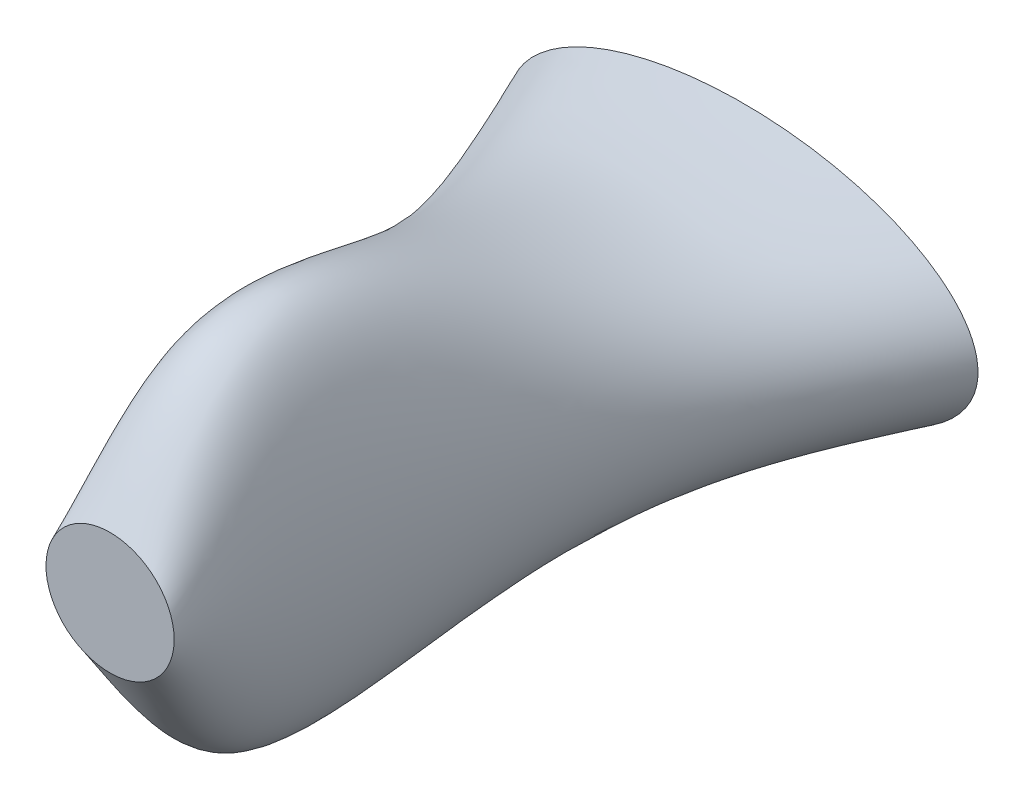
ISO-10303-21;
HEADER;
FILE_DESCRIPTION(('STEP AP214'),'2;1');
FILE_NAME('part.step','',(''),(''),'','','');
FILE_SCHEMA(('AUTOMOTIVE_DESIGN { 1 0 10303 214 1 1 1 1 }'));
ENDSEC;
DATA;
#1=APPLICATION_CONTEXT('core data for automotive mechanical design processes');
#2=APPLICATION_PROTOCOL_DEFINITION('international standard','automotive_design',2000,#1);
#3=PRODUCT_CONTEXT('',#1,'mechanical');
#4=PRODUCT('Part','Part','',(#3));
#5=PRODUCT_RELATED_PRODUCT_CATEGORY('part','',(#4));
#6=PRODUCT_DEFINITION_FORMATION('','',#4);
#7=PRODUCT_DEFINITION_CONTEXT('part definition',#1,'design');
#8=PRODUCT_DEFINITION('design','',#6,#7);
#9=PRODUCT_DEFINITION_SHAPE('','',#8);
#10=(LENGTH_UNIT() NAMED_UNIT(*) SI_UNIT(.MILLI.,.METRE.));
#11=(NAMED_UNIT(*) PLANE_ANGLE_UNIT() SI_UNIT($,.RADIAN.));
#12=(NAMED_UNIT(*) SI_UNIT($,.STERADIAN.) SOLID_ANGLE_UNIT());
#13=UNCERTAINTY_MEASURE_WITH_UNIT(LENGTH_MEASURE(1.E-05),#10,'distance_accuracy_value','');
#14=(GEOMETRIC_REPRESENTATION_CONTEXT(3) GLOBAL_UNCERTAINTY_ASSIGNED_CONTEXT((#13)) GLOBAL_UNIT_ASSIGNED_CONTEXT((#10,
#11,#12)) REPRESENTATION_CONTEXT('',''));
#15=CARTESIAN_POINT('',(0.,0.,0.));
#16=DIRECTION('',(0.,0.,1.));
#17=DIRECTION('',(1.,0.,0.));
#18=AXIS2_PLACEMENT_3D('',#15,#16,#17);
#19=CARTESIAN_POINT('',(0.,0.,-151.464362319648));
#20=DIRECTION('',(0.,0.,1.));
#21=DIRECTION('',(1.,0.,0.));
#22=AXIS2_PLACEMENT_3D('',#19,#20,#21);
#23=PLANE('',#22);
#24=CARTESIAN_POINT('',(0.,0.,-151.464362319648));
#25=DIRECTION('',(0.,0.,1.));
#26=DIRECTION('',(1.,0.,0.));
#27=AXIS2_PLACEMENT_3D('',#24,#25,#26);
#28=ELLIPSE('',#27,56.0560264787,27.662831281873);
#29=CARTESIAN_POINT('',(56.0560264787,0.,-151.464362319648));
#30=VERTEX_POINT('',#29);
#31=EDGE_CURVE('E102',#30,#30,#28,.T.);
#32=ORIENTED_EDGE('',*,*,#31,.F.);
#33=EDGE_LOOP('',(#32));
#34=FACE_BOUND('',#33,.T.);
#35=ADVANCED_FACE('F94',(#34),#23,.F.);
#36=CARTESIAN_POINT('',(0.,0.,0.));
#37=DIRECTION('',(0.,0.,1.));
#38=DIRECTION('',(1.,0.,0.));
#39=AXIS2_PLACEMENT_3D('',#36,#37,#38);
#40=PLANE('',#39);
#41=CARTESIAN_POINT('',(0.,0.,0.));
#42=DIRECTION('',(0.,0.,1.));
#43=DIRECTION('',(1.,0.,0.));
#44=AXIS2_PLACEMENT_3D('',#41,#42,#43);
#45=ELLIPSE('',#44,15.323084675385,14.5548406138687);
#46=CARTESIAN_POINT('',(15.323084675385,0.,0.));
#47=VERTEX_POINT('',#46);
#48=EDGE_CURVE('E12',#47,#47,#45,.T.);
#49=ORIENTED_EDGE('',*,*,#48,.T.);
#50=EDGE_LOOP('',(#49));
#51=FACE_BOUND('',#50,.T.);
#52=ADVANCED_FACE('F144',(#51),#40,.T.);
#53=CARTESIAN_POINT('',(15.323084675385,0.,0.));
#54=CARTESIAN_POINT('',(15.3993080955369,0.,-0.66532531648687));
#55=CARTESIAN_POINT('',(15.5517560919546,0.,-1.99598604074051));
#56=CARTESIAN_POINT('',(15.824305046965,0.,-4.37218259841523));
#57=CARTESIAN_POINT('',(16.1916155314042,0.,-7.56495651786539));
#58=CARTESIAN_POINT('',(16.619680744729,0.,-11.2566488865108));
#59=CARTESIAN_POINT('',(17.2613260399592,0.,-16.7174876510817));
#60=CARTESIAN_POINT('',(18.0074529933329,0.,-22.9079992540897));
#61=CARTESIAN_POINT('',(19.0113616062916,0.,-30.8443730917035));
#62=CARTESIAN_POINT('',(20.0065167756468,0.,-38.2537321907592));
#63=CARTESIAN_POINT('',(21.5855694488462,0.,-49.1798447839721));
#64=CARTESIAN_POINT('',(23.6306111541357,0.,-61.7064441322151));
#65=CARTESIAN_POINT('',(26.5409685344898,0.,-75.7873008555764));
#66=CARTESIAN_POINT('',(29.4590392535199,0.,-87.1882583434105));
#67=CARTESIAN_POINT('',(32.8723830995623,0.,-98.2047484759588));
#68=CARTESIAN_POINT('',(36.6541926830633,0.,-108.547991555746));
#69=CARTESIAN_POINT('',(40.617805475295,0.,-118.193903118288));
#70=CARTESIAN_POINT('',(43.8859964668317,0.,-125.640452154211));
#71=CARTESIAN_POINT('',(46.6965338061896,0.,-131.806796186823));
#72=CARTESIAN_POINT('',(49.172684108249,0.,-137.101183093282));
#73=CARTESIAN_POINT('',(51.6376850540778,0.,-142.286515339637));
#74=CARTESIAN_POINT('',(53.539104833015,0.,-146.244765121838));
#75=CARTESIAN_POINT('',(55.0545261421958,0.,-149.388658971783));
#76=CARTESIAN_POINT('',(55.7221727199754,0.,-150.772419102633));
#77=CARTESIAN_POINT('',(56.0560264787,0.,-151.464362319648));
#78=CARTESIAN_POINT('',(15.323084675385,-8.03303500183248,0.));
#79=CARTESIAN_POINT('',(15.3993080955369,-8.62540440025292,-0.66532531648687));
#80=CARTESIAN_POINT('',(15.5517560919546,-9.81015218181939,-1.99598604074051));
#81=CARTESIAN_POINT('',(15.824305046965,-11.8901105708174,-4.37218259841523));
#82=CARTESIAN_POINT('',(16.1916155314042,-14.5654500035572,-7.56495651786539));
#83=CARTESIAN_POINT('',(16.619680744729,-17.3215088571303,-11.2566488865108));
#84=CARTESIAN_POINT('',(17.2613260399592,-20.7094441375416,-16.7174876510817));
#85=CARTESIAN_POINT('',(18.0074529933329,-23.2738923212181,-22.9079992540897));
#86=CARTESIAN_POINT('',(19.0113616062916,-24.6886985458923,-30.8443730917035));
#87=CARTESIAN_POINT('',(20.0065167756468,-24.9453201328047,-38.2537321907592));
#88=CARTESIAN_POINT('',(21.5855694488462,-24.3547750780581,-49.1798447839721));
#89=CARTESIAN_POINT('',(23.6306111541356,-22.5209098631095,-61.7064441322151));
#90=CARTESIAN_POINT('',(26.5409685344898,-19.9379436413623,-75.7873008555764));
#91=CARTESIAN_POINT('',(29.4590392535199,-17.9657098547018,-87.1882583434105));
#92=CARTESIAN_POINT('',(32.8723830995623,-16.4025371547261,-98.2047484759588));
#93=CARTESIAN_POINT('',(36.6541926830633,-15.3149863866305,-108.547991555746));
#94=CARTESIAN_POINT('',(40.617805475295,-14.7413973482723,-118.193903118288));
#95=CARTESIAN_POINT('',(43.8859964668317,-14.5813491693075,-125.640452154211));
#96=CARTESIAN_POINT('',(46.6965338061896,-14.6107860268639,-131.806796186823));
#97=CARTESIAN_POINT('',(49.172684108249,-14.7255899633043,-137.101183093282));
#98=CARTESIAN_POINT('',(51.6376850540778,-14.8939135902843,-142.286515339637));
#99=CARTESIAN_POINT('',(53.539104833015,-15.0494373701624,-146.244765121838));
#100=CARTESIAN_POINT('',(55.0545261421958,-15.180010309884,-149.388658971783));
#101=CARTESIAN_POINT('',(55.7221727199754,-15.2383561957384,-150.772419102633));
#102=CARTESIAN_POINT('',(56.0560264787,-15.267531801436,-151.464362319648));
#103=CARTESIAN_POINT('',(8.45704043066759,-14.5548406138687,0.));
#104=CARTESIAN_POINT('',(8.4991092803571,-15.6281388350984,-0.66532531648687));
#105=CARTESIAN_POINT('',(8.58324761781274,-17.7747515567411,-1.99598604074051));
#106=CARTESIAN_POINT('',(8.73367147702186,-21.5433723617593,-4.37218259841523));
#107=CARTESIAN_POINT('',(8.93639564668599,-26.39074810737,-7.56495651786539));
#108=CARTESIAN_POINT('',(9.17265126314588,-31.3843772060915,-11.2566488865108));
#109=CARTESIAN_POINT('',(9.52678493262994,-37.5228862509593,-16.7174876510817));
#110=CARTESIAN_POINT('',(9.93858359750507,-42.1693411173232,-22.9079992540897));
#111=CARTESIAN_POINT('',(10.4926558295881,-44.7327905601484,-30.8443730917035));
#112=CARTESIAN_POINT('',(11.0418969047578,-45.1977563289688,-38.2537321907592));
#113=CARTESIAN_POINT('',(11.9133997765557,-44.1277635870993,-49.1798447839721));
#114=CARTESIAN_POINT('',(13.0420889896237,-40.8050324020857,-61.7064441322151));
#115=CARTESIAN_POINT('',(14.6483589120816,-36.1250251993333,-75.7873008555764));
#116=CARTESIAN_POINT('',(16.2588859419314,-32.5515877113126,-87.1882583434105));
#117=CARTESIAN_POINT('',(18.1427616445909,-29.719317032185,-98.2047484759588));
#118=CARTESIAN_POINT('',(20.2299991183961,-27.7488129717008,-108.547991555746));
#119=CARTESIAN_POINT('',(22.417576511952,-26.7095423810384,-118.193903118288));
#120=CARTESIAN_POINT('',(24.2213401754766,-26.4195553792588,-125.640452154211));
#121=CARTESIAN_POINT('',(25.7725179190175,-26.472891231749,-131.806796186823));
#122=CARTESIAN_POINT('',(27.1391424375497,-26.6809014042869,-137.101183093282));
#123=CARTESIAN_POINT('',(28.4996134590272,-26.9858824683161,-142.286515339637));
#124=CARTESIAN_POINT('',(29.5490355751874,-27.2676718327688,-146.244765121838));
#125=CARTESIAN_POINT('',(30.3854193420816,-27.5042534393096,-149.388658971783));
#126=CARTESIAN_POINT('',(30.7539035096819,-27.6099687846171,-150.772419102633));
#127=CARTESIAN_POINT('',(30.9381624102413,-27.662831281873,-151.464362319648));
#128=CARTESIAN_POINT('',(-8.4570404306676,-14.5548406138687,0.));
#129=CARTESIAN_POINT('',(-8.49910928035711,-15.6281388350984,-0.66532531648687));
#130=CARTESIAN_POINT('',(-8.58324761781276,-17.7747515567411,-1.99598604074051));
#131=CARTESIAN_POINT('',(-8.73367147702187,-21.5433723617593,-4.37218259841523));
#132=CARTESIAN_POINT('',(-8.936395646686,-26.39074810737,-7.56495651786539));
#133=CARTESIAN_POINT('',(-9.17265126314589,-31.3843772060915,-11.2566488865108));
#134=CARTESIAN_POINT('',(-9.52678493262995,-37.5228862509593,-16.7174876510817));
#135=CARTESIAN_POINT('',(-9.93858359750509,-42.1693411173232,-22.9079992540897));
#136=CARTESIAN_POINT('',(-10.4926558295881,-44.7327905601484,-30.8443730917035));
#137=CARTESIAN_POINT('',(-11.0418969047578,-45.1977563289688,-38.2537321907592));
#138=CARTESIAN_POINT('',(-11.9133997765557,-44.1277635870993,-49.1798447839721));
#139=CARTESIAN_POINT('',(-13.0420889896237,-40.8050324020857,-61.7064441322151));
#140=CARTESIAN_POINT('',(-14.6483589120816,-36.1250251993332,-75.7873008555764));
#141=CARTESIAN_POINT('',(-16.2588859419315,-32.5515877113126,-87.1882583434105));
#142=CARTESIAN_POINT('',(-18.1427616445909,-29.719317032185,-98.2047484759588));
#143=CARTESIAN_POINT('',(-20.2299991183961,-27.7488129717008,-108.547991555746));
#144=CARTESIAN_POINT('',(-22.417576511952,-26.7095423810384,-118.193903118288));
#145=CARTESIAN_POINT('',(-24.2213401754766,-26.4195553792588,-125.640452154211));
#146=CARTESIAN_POINT('',(-25.7725179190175,-26.472891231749,-131.806796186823));
#147=CARTESIAN_POINT('',(-27.1391424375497,-26.6809014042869,-137.101183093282));
#148=CARTESIAN_POINT('',(-28.4996134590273,-26.9858824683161,-142.286515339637));
#149=CARTESIAN_POINT('',(-29.5490355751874,-27.2676718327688,-146.244765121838));
#150=CARTESIAN_POINT('',(-30.3854193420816,-27.5042534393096,-149.388658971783));
#151=CARTESIAN_POINT('',(-30.7539035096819,-27.6099687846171,-150.772419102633));
#152=CARTESIAN_POINT('',(-30.9381624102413,-27.662831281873,-151.464362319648));
#153=CARTESIAN_POINT('',(-15.323084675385,-8.03303500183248,0.));
#154=CARTESIAN_POINT('',(-15.3993080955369,-8.62540440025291,-0.66532531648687));
#155=CARTESIAN_POINT('',(-15.5517560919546,-9.81015218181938,-1.99598604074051));
#156=CARTESIAN_POINT('',(-15.824305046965,-11.8901105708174,-4.37218259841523));
#157=CARTESIAN_POINT('',(-16.1916155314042,-14.5654500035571,-7.56495651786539));
#158=CARTESIAN_POINT('',(-16.619680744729,-17.3215088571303,-11.2566488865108));
#159=CARTESIAN_POINT('',(-17.2613260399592,-20.7094441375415,-16.7174876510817));
#160=CARTESIAN_POINT('',(-18.0074529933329,-23.273892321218,-22.9079992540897));
#161=CARTESIAN_POINT('',(-19.0113616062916,-24.6886985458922,-30.8443730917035));
#162=CARTESIAN_POINT('',(-20.0065167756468,-24.9453201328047,-38.2537321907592));
#163=CARTESIAN_POINT('',(-21.5855694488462,-24.3547750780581,-49.1798447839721));
#164=CARTESIAN_POINT('',(-23.6306111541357,-22.5209098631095,-61.7064441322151));
#165=CARTESIAN_POINT('',(-26.5409685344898,-19.9379436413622,-75.7873008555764));
#166=CARTESIAN_POINT('',(-29.4590392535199,-17.9657098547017,-87.1882583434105));
#167=CARTESIAN_POINT('',(-32.8723830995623,-16.4025371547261,-98.2047484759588));
#168=CARTESIAN_POINT('',(-36.6541926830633,-15.3149863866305,-108.547991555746));
#169=CARTESIAN_POINT('',(-40.617805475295,-14.7413973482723,-118.193903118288));
#170=CARTESIAN_POINT('',(-43.8859964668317,-14.5813491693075,-125.640452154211));
#171=CARTESIAN_POINT('',(-46.6965338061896,-14.6107860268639,-131.806796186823));
#172=CARTESIAN_POINT('',(-49.172684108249,-14.7255899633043,-137.101183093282));
#173=CARTESIAN_POINT('',(-51.6376850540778,-14.8939135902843,-142.286515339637));
#174=CARTESIAN_POINT('',(-53.539104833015,-15.0494373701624,-146.244765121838));
#175=CARTESIAN_POINT('',(-55.0545261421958,-15.180010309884,-149.388658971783));
#176=CARTESIAN_POINT('',(-55.7221727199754,-15.2383561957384,-150.772419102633));
#177=CARTESIAN_POINT('',(-56.0560264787,-15.267531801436,-151.464362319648));
#178=CARTESIAN_POINT('',(-15.323084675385,8.03303500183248,0.));
#179=CARTESIAN_POINT('',(-15.3993080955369,8.62540440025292,-0.66532531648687));
#180=CARTESIAN_POINT('',(-15.5517560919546,9.81015218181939,-1.99598604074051));
#181=CARTESIAN_POINT('',(-15.824305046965,11.8901105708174,-4.37218259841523));
#182=CARTESIAN_POINT('',(-16.1916155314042,14.5654500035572,-7.56495651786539));
#183=CARTESIAN_POINT('',(-16.619680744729,17.3215088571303,-11.2566488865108));
#184=CARTESIAN_POINT('',(-17.2613260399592,20.7094441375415,-16.7174876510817));
#185=CARTESIAN_POINT('',(-18.0074529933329,23.2738923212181,-22.9079992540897));
#186=CARTESIAN_POINT('',(-19.0113616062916,24.6886985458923,-30.8443730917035));
#187=CARTESIAN_POINT('',(-20.0065167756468,24.9453201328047,-38.2537321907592));
#188=CARTESIAN_POINT('',(-21.5855694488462,24.3547750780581,-49.1798447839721));
#189=CARTESIAN_POINT('',(-23.6306111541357,22.5209098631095,-61.7064441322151));
#190=CARTESIAN_POINT('',(-26.5409685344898,19.9379436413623,-75.7873008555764));
#191=CARTESIAN_POINT('',(-29.4590392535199,17.9657098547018,-87.1882583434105));
#192=CARTESIAN_POINT('',(-32.8723830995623,16.4025371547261,-98.2047484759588));
#193=CARTESIAN_POINT('',(-36.6541926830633,15.3149863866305,-108.547991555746));
#194=CARTESIAN_POINT('',(-40.617805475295,14.7413973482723,-118.193903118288));
#195=CARTESIAN_POINT('',(-43.8859964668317,14.5813491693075,-125.640452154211));
#196=CARTESIAN_POINT('',(-46.6965338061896,14.6107860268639,-131.806796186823));
#197=CARTESIAN_POINT('',(-49.172684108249,14.7255899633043,-137.101183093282));
#198=CARTESIAN_POINT('',(-51.6376850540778,14.8939135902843,-142.286515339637));
#199=CARTESIAN_POINT('',(-53.539104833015,15.0494373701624,-146.244765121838));
#200=CARTESIAN_POINT('',(-55.0545261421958,15.180010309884,-149.388658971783));
#201=CARTESIAN_POINT('',(-55.7221727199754,15.2383561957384,-150.772419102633));
#202=CARTESIAN_POINT('',(-56.0560264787,15.267531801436,-151.464362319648));
#203=CARTESIAN_POINT('',(-8.45704043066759,14.5548406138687,0.));
#204=CARTESIAN_POINT('',(-8.4991092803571,15.6281388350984,-0.66532531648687));
#205=CARTESIAN_POINT('',(-8.58324761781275,17.7747515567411,-1.99598604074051));
#206=CARTESIAN_POINT('',(-8.73367147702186,21.5433723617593,-4.37218259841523));
#207=CARTESIAN_POINT('',(-8.93639564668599,26.39074810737,-7.56495651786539));
#208=CARTESIAN_POINT('',(-9.17265126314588,31.3843772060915,-11.2566488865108));
#209=CARTESIAN_POINT('',(-9.52678493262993,37.5228862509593,-16.7174876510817));
#210=CARTESIAN_POINT('',(-9.93858359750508,42.1693411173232,-22.9079992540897));
#211=CARTESIAN_POINT('',(-10.4926558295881,44.7327905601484,-30.8443730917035));
#212=CARTESIAN_POINT('',(-11.0418969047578,45.1977563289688,-38.2537321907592));
#213=CARTESIAN_POINT('',(-11.9133997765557,44.1277635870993,-49.1798447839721));
#214=CARTESIAN_POINT('',(-13.0420889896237,40.8050324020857,-61.7064441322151));
#215=CARTESIAN_POINT('',(-14.6483589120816,36.1250251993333,-75.7873008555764));
#216=CARTESIAN_POINT('',(-16.2588859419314,32.5515877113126,-87.1882583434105));
#217=CARTESIAN_POINT('',(-18.1427616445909,29.719317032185,-98.2047484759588));
#218=CARTESIAN_POINT('',(-20.2299991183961,27.7488129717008,-108.547991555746));
#219=CARTESIAN_POINT('',(-22.417576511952,26.7095423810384,-118.193903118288));
#220=CARTESIAN_POINT('',(-24.2213401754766,26.4195553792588,-125.640452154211));
#221=CARTESIAN_POINT('',(-25.7725179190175,26.472891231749,-131.806796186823));
#222=CARTESIAN_POINT('',(-27.1391424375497,26.6809014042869,-137.101183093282));
#223=CARTESIAN_POINT('',(-28.4996134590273,26.9858824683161,-142.286515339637));
#224=CARTESIAN_POINT('',(-29.5490355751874,27.2676718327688,-146.244765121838));
#225=CARTESIAN_POINT('',(-30.3854193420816,27.5042534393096,-149.388658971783));
#226=CARTESIAN_POINT('',(-30.7539035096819,27.6099687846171,-150.772419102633));
#227=CARTESIAN_POINT('',(-30.9381624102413,27.662831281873,-151.464362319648));
#228=CARTESIAN_POINT('',(8.45704043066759,14.5548406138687,0.));
#229=CARTESIAN_POINT('',(8.4991092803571,15.6281388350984,-0.66532531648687));
#230=CARTESIAN_POINT('',(8.58324761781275,17.7747515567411,-1.99598604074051));
#231=CARTESIAN_POINT('',(8.73367147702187,21.5433723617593,-4.37218259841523));
#232=CARTESIAN_POINT('',(8.936395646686,26.39074810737,-7.56495651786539));
#233=CARTESIAN_POINT('',(9.17265126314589,31.3843772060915,-11.2566488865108));
#234=CARTESIAN_POINT('',(9.52678493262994,37.5228862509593,-16.7174876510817));
#235=CARTESIAN_POINT('',(9.93858359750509,42.1693411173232,-22.9079992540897));
#236=CARTESIAN_POINT('',(10.4926558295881,44.7327905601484,-30.8443730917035));
#237=CARTESIAN_POINT('',(11.0418969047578,45.1977563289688,-38.2537321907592));
#238=CARTESIAN_POINT('',(11.9133997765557,44.1277635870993,-49.1798447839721));
#239=CARTESIAN_POINT('',(13.0420889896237,40.8050324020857,-61.7064441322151));
#240=CARTESIAN_POINT('',(14.6483589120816,36.1250251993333,-75.7873008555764));
#241=CARTESIAN_POINT('',(16.2588859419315,32.5515877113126,-87.1882583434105));
#242=CARTESIAN_POINT('',(18.1427616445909,29.719317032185,-98.2047484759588));
#243=CARTESIAN_POINT('',(20.2299991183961,27.7488129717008,-108.547991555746));
#244=CARTESIAN_POINT('',(22.417576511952,26.7095423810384,-118.193903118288));
#245=CARTESIAN_POINT('',(24.2213401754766,26.4195553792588,-125.640452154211));
#246=CARTESIAN_POINT('',(25.7725179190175,26.472891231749,-131.806796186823));
#247=CARTESIAN_POINT('',(27.1391424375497,26.6809014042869,-137.101183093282));
#248=CARTESIAN_POINT('',(28.4996134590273,26.9858824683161,-142.286515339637));
#249=CARTESIAN_POINT('',(29.5490355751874,27.2676718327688,-146.244765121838));
#250=CARTESIAN_POINT('',(30.3854193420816,27.5042534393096,-149.388658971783));
#251=CARTESIAN_POINT('',(30.7539035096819,27.6099687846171,-150.772419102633));
#252=CARTESIAN_POINT('',(30.9381624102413,27.662831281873,-151.464362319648));
#253=CARTESIAN_POINT('',(15.323084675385,8.03303500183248,0.));
#254=CARTESIAN_POINT('',(15.3993080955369,8.62540440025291,-0.66532531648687));
#255=CARTESIAN_POINT('',(15.5517560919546,9.81015218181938,-1.99598604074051));
#256=CARTESIAN_POINT('',(15.824305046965,11.8901105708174,-4.37218259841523));
#257=CARTESIAN_POINT('',(16.1916155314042,14.5654500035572,-7.56495651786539));
#258=CARTESIAN_POINT('',(16.619680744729,17.3215088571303,-11.2566488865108));
#259=CARTESIAN_POINT('',(17.2613260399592,20.7094441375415,-16.7174876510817));
#260=CARTESIAN_POINT('',(18.0074529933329,23.273892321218,-22.9079992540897));
#261=CARTESIAN_POINT('',(19.0113616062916,24.6886985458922,-30.8443730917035));
#262=CARTESIAN_POINT('',(20.0065167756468,24.9453201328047,-38.2537321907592));
#263=CARTESIAN_POINT('',(21.5855694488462,24.3547750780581,-49.1798447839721));
#264=CARTESIAN_POINT('',(23.6306111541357,22.5209098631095,-61.7064441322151));
#265=CARTESIAN_POINT('',(26.5409685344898,19.9379436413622,-75.7873008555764));
#266=CARTESIAN_POINT('',(29.4590392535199,17.9657098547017,-87.1882583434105));
#267=CARTESIAN_POINT('',(32.8723830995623,16.4025371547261,-98.2047484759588));
#268=CARTESIAN_POINT('',(36.6541926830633,15.3149863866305,-108.547991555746));
#269=CARTESIAN_POINT('',(40.617805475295,14.7413973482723,-118.193903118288));
#270=CARTESIAN_POINT('',(43.8859964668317,14.5813491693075,-125.640452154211));
#271=CARTESIAN_POINT('',(46.6965338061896,14.6107860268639,-131.806796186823));
#272=CARTESIAN_POINT('',(49.172684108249,14.7255899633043,-137.101183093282));
#273=CARTESIAN_POINT('',(51.6376850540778,14.8939135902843,-142.286515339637));
#274=CARTESIAN_POINT('',(53.539104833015,15.0494373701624,-146.244765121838));
#275=CARTESIAN_POINT('',(55.0545261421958,15.180010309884,-149.388658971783));
#276=CARTESIAN_POINT('',(55.7221727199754,15.2383561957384,-150.772419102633));
#277=CARTESIAN_POINT('',(56.0560264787,15.267531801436,-151.464362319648));
#278=CARTESIAN_POINT('',(15.323084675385,0.,0.));
#279=CARTESIAN_POINT('',(15.3993080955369,0.,-0.66532531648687));
#280=CARTESIAN_POINT('',(15.5517560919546,0.,-1.99598604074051));
#281=CARTESIAN_POINT('',(15.824305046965,0.,-4.37218259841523));
#282=CARTESIAN_POINT('',(16.1916155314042,0.,-7.56495651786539));
#283=CARTESIAN_POINT('',(16.619680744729,0.,-11.2566488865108));
#284=CARTESIAN_POINT('',(17.2613260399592,0.,-16.7174876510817));
#285=CARTESIAN_POINT('',(18.0074529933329,0.,-22.9079992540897));
#286=CARTESIAN_POINT('',(19.0113616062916,0.,-30.8443730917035));
#287=CARTESIAN_POINT('',(20.0065167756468,0.,-38.2537321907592));
#288=CARTESIAN_POINT('',(21.5855694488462,0.,-49.1798447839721));
#289=CARTESIAN_POINT('',(23.6306111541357,0.,-61.7064441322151));
#290=CARTESIAN_POINT('',(26.5409685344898,0.,-75.7873008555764));
#291=CARTESIAN_POINT('',(29.4590392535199,0.,-87.1882583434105));
#292=CARTESIAN_POINT('',(32.8723830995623,0.,-98.2047484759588));
#293=CARTESIAN_POINT('',(36.6541926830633,0.,-108.547991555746));
#294=CARTESIAN_POINT('',(40.617805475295,0.,-118.193903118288));
#295=CARTESIAN_POINT('',(43.8859964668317,0.,-125.640452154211));
#296=CARTESIAN_POINT('',(46.6965338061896,0.,-131.806796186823));
#297=CARTESIAN_POINT('',(49.172684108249,0.,-137.101183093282));
#298=CARTESIAN_POINT('',(51.6376850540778,0.,-142.286515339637));
#299=CARTESIAN_POINT('',(53.539104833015,0.,-146.244765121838));
#300=CARTESIAN_POINT('',(55.0545261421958,0.,-149.388658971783));
#301=CARTESIAN_POINT('',(55.7221727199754,0.,-150.772419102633));
#302=CARTESIAN_POINT('',(56.0560264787,0.,-151.464362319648));
#303=B_SPLINE_SURFACE_WITH_KNOTS('',3,3,((#53,#54,#55,#56,#57,#58,#59,#60,#61,#62,#63,#64,#65,
#66,#67,#68,#69,#70,#71,#72,#73,#74,#75,#76,#77),(#78,#79,#80,#81,#82,#83,#84,#85,#86,#87,#88,
#89,#90,#91,#92,#93,#94,#95,#96,#97,#98,#99,#100,#101,#102),(#103,#104,#105,#106,#107,#108,#109,
#110,#111,#112,#113,#114,#115,#116,#117,#118,#119,#120,#121,#122,#123,#124,#125,#126,#127),
(#128,#129,#130,#131,#132,#133,#134,#135,#136,#137,#138,#139,#140,#141,#142,#143,#144,#145,#146,
#147,#148,#149,#150,#151,#152),(#153,#154,#155,#156,#157,#158,#159,#160,#161,#162,#163,#164,
#165,#166,#167,#168,#169,#170,#171,#172,#173,#174,#175,#176,#177),(#178,#179,#180,#181,#182,
#183,#184,#185,#186,#187,#188,#189,#190,#191,#192,#193,#194,#195,#196,#197,#198,#199,#200,#201,
#202),(#203,#204,#205,#206,#207,#208,#209,#210,#211,#212,#213,#214,#215,#216,#217,#218,#219,
#220,#221,#222,#223,#224,#225,#226,#227),(#228,#229,#230,#231,#232,#233,#234,#235,#236,#237,
#238,#239,#240,#241,#242,#243,#244,#245,#246,#247,#248,#249,#250,#251,#252),(#253,#254,#255,
#256,#257,#258,#259,#260,#261,#262,#263,#264,#265,#266,#267,#268,#269,#270,#271,#272,#273,#274,
#275,#276,#277),(#278,#279,#280,#281,#282,#283,#284,#285,#286,#287,#288,#289,#290,#291,#292,
#293,#294,#295,#296,#297,#298,#299,#300,#301,#302)),.UNSPECIFIED.,.T.,.F.,.F.,(4,2,2,2,4),(4,1,
1,1,1,1,1,1,1,1,1,1,1,1,1,1,1,1,1,1,1,1,4),(0.,0.25,0.5,0.75,1.),(0.,0.0127112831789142,
0.0254227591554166,0.045398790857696,0.0737137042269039,0.0959649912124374,0.149765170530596,
0.192066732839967,0.247806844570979,0.291663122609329,0.401613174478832,0.488665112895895,
0.564500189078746,0.624894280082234,0.707508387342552,0.773439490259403,0.822814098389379,
0.861858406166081,0.902066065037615,0.933754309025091,0.970837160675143,0.985417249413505,1.),.UNSPECIFIED.);
#304=ORIENTED_EDGE('',*,*,#48,.F.);
#305=EDGE_LOOP('',(#304));
#306=FACE_BOUND('',#305,.T.);
#307=ORIENTED_EDGE('',*,*,#31,.T.);
#308=EDGE_LOOP('',(#307));
#309=FACE_BOUND('',#308,.T.);
#310=ADVANCED_FACE('F127',(#306,#309),#303,.T.);
#311=CLOSED_SHELL('',(#35,#52,#310));
#312=MANIFOLD_SOLID_BREP('B2',#311);
#313=ADVANCED_BREP_SHAPE_REPRESENTATION('',(#18,#312),#14);
#314=SHAPE_DEFINITION_REPRESENTATION(#9,#313);
ENDSEC;
END-ISO-10303-21;
